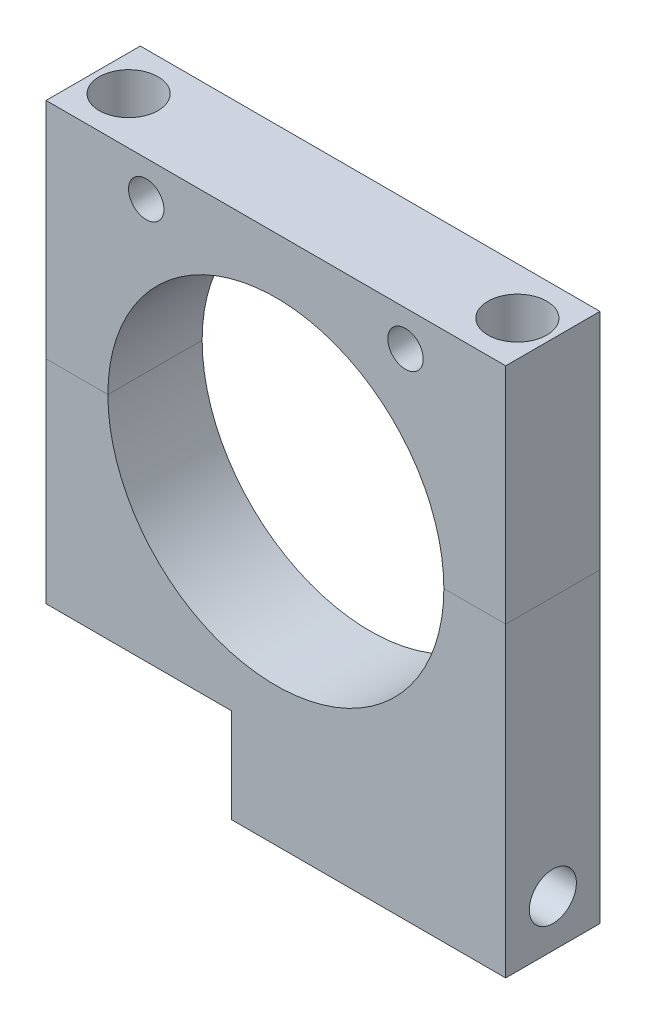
from build123d import *

# Parameters (mm, degrees)
BOSS_EXTRUDE1_DEPTH     = 6.35
BOSS_EXTRUDE2_DEPTH     = 6.35
CUT_EXTRUDE1_DEPTH      = 50.8
CUT_EXTRUDE1_DEPTH_BACK = 19.05
SKETCH5_R               = 2.3876
CUT_EXTRUDE2_START      = 14.2748
SKETCH6_R               = 3.9624
CUT_EXTRUDE2_DEPTH      = 25.4
CUT_EXTRUDE3_DEPTH      = 33.02
CUT_EXTRUDE3_DEPTH_BACK = 25.4
SKETCH7_R               = 3.175
SKETCH8_R               = 2.3876
CUT_EXTRUDE4_DEPTH      = 12.7


with BuildPart() as part:
    # Sketch2 → Boss-Extrude1 (new, symmetric)
    with BuildSketch(Plane.XY):
        with BuildLine():
            Line((-30.9626, 0), (-22.6314, 0))
            ThreePointArc((-22.6314, 0), (0, 22.6314), (22.6314, 0))
            Line((22.6314, 0), (30.9626, 0))
            Line((30.9626, 0), (30.9626, 30.1498))
            Line((30.9626, 30.1498), (-30.9626, 30.1498))
            Line((-30.9626, 30.1498), (-30.9626, 0))
        make_face()
    extrude(amount=BOSS_EXTRUDE1_DEPTH, both=True)


with BuildPart() as body_2:
    # Sketch3 → Boss-Extrude2 (new, symmetric)
    with BuildSketch(Plane.XY):
        with BuildLine():
            Line((-30.9626, 0), (-22.6314, 0))
            ThreePointArc((-22.6314, 0), (0, -22.6314), (22.6314, 0))
            Line((22.6314, 0), (30.9626, 0))
            Line((30.9626, 0), (30.9626, -41.275))
            Line((30.9626, -41.275), (-5.969, -41.275))
            Line((-5.969, -41.275), (-5.969, -28.575))
            Line((-5.969, -28.575), (-30.9626, -28.575))
            Line((-30.9626, -28.575), (-30.9626, 0))
        make_face()
    extrude(amount=BOSS_EXTRUDE2_DEPTH, both=True)


with BuildPart() as cut_extrude1_tool:
    # Sketch5 → Cut-Extrude1 (new, two sides: drawn at the far end of the back side and taken through both)
    with BuildSketch(Plane(origin=(0, 0, 0), x_dir=(1, 0, 0), z_dir=(0, 1, 0)).offset(-CUT_EXTRUDE1_DEPTH_BACK)):
        with Locations(Location((-26.1874, 0, 0), (0, 0, 90))):
            Circle(SKETCH5_R)
        with Locations(Location((26.1874, 0, 0), (0, 0, 90))):
            Circle(SKETCH5_R)
    extrude(amount=CUT_EXTRUDE1_DEPTH + CUT_EXTRUDE1_DEPTH_BACK)


with BuildPart() as part_1:
    add(part.part)

    # Cut-Extrude1: cut by cut_extrude1_tool
    add(cut_extrude1_tool.part, mode=Mode.SUBTRACT)

    # Sketch6 → Cut-Extrude2 (cut)
    with BuildSketch(Plane(origin=(0, 0, 0), x_dir=(1, 0, 0), z_dir=(0, 1, 0)).offset(CUT_EXTRUDE2_START)):
        with Locations(Location((-26.1874, 0, 0), (0, 0, 90))):
            Circle(SKETCH6_R)
        with Locations(Location((26.1874, 0, 0), (0, 0, 90))):
            Circle(SKETCH6_R)
    extrude(amount=CUT_EXTRUDE2_DEPTH, mode=Mode.SUBTRACT)

    # Sketch8 → Cut-Extrude4 (cut, symmetric)
    with BuildSketch(Plane.XY):
        with Locations((-17.4625, 25.3746)):
            Circle(SKETCH8_R)
        with Locations((17.4625, 25.3746)):
            Circle(SKETCH8_R)
    extrude(amount=CUT_EXTRUDE4_DEPTH, both=True, mode=Mode.SUBTRACT)


with BuildPart() as body_2_1:
    add(body_2.part)

    # Cut-Extrude1: cut by cut_extrude1_tool
    add(cut_extrude1_tool.part, mode=Mode.SUBTRACT)

    # Sketch7 → Cut-Extrude3 (cut, two sides: drawn at the far end of the back side and taken through both)
    with BuildSketch(Plane(origin=(0, 0, 0), x_dir=(0, 0, -1), z_dir=(1, 0, 0)).offset(-CUT_EXTRUDE3_DEPTH_BACK)):
        with Locations(Location((0, -34.925, 0), (0, 0, 180))):
            Circle(SKETCH7_R)
    extrude(amount=CUT_EXTRUDE3_DEPTH + CUT_EXTRUDE3_DEPTH_BACK, mode=Mode.SUBTRACT)


solid = Compound([part_1.part, body_2_1.part])
